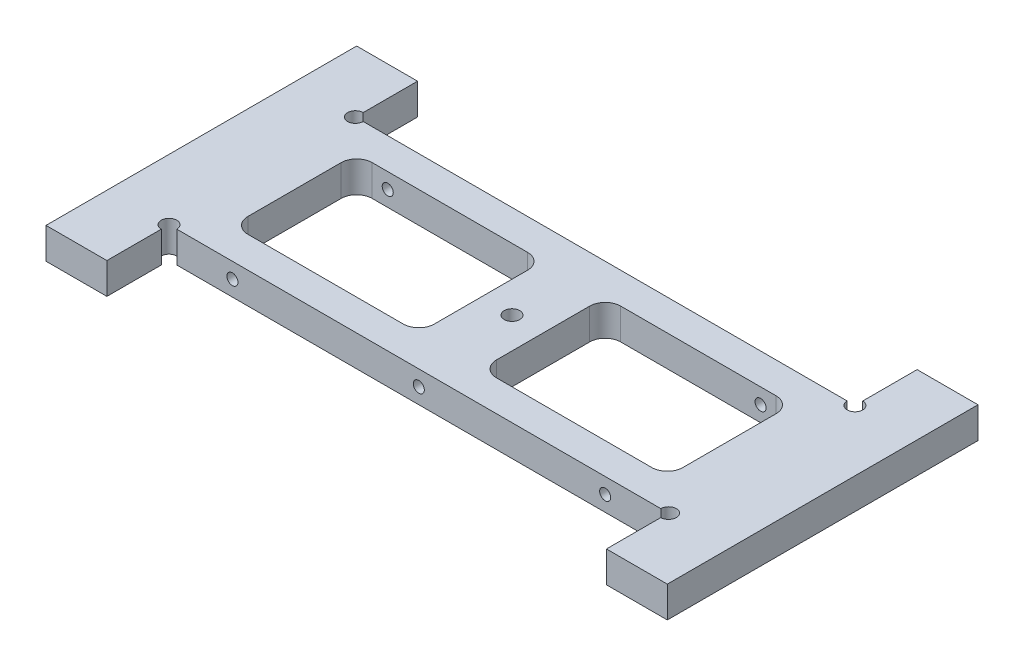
from build123d import *

# Parameters (mm, degrees)
BOSS_EXTRUDE1_DEPTH          = 19.05
BOSS_EXTRUDE1_DEPTH_BACK     = 19.05
SKETCH1_W                    = 101.6
SKETCH1_H                    = 6.35
F_4_40_TAPPED_HOLE1_D        = 2.2606
F_1_8_0_125_DIAMETER_HOLE1_D = 3.175
SKETCH8_W                    = 63.5
SKETCH8_H                    = 6.35
BOSS_EXTRUDE2_DEPTH          = 12.7
SKETCH11_W                   = 0.254
SKETCH11_H                   = 12.7
CUT_EXTRUDE4_DEPTH           = 72.278573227
SKETCH9_R                    = 1.5875
CUT_EXTRUDE2_DEPTH           = 72.278573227
SKETCH10_W                   = 38.1
SKETCH10_H                   = 25.4
CUT_EXTRUDE3_DEPTH           = 72.278573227
FILLET1_R                    = 3.175


with BuildPart() as part:
    # Sketch1 → Boss-Extrude1 (new, two sides: drawn at the far end of the back side and taken through both)
    with BuildSketch(Plane.XY.offset(-BOSS_EXTRUDE1_DEPTH_BACK)):
        Rectangle(SKETCH1_W, SKETCH1_H)
    extrude(amount=BOSS_EXTRUDE1_DEPTH + BOSS_EXTRUDE1_DEPTH_BACK)

    # 4-40 Tapped Hole1 (through all)
    with Locations(Plane.XY.offset(19.05)):
        with Locations((-38.1, 0), (0, 0), (38.1, 0)):
            Hole(F_4_40_TAPPED_HOLE1_D / 2)

    # 1_8 _0.125_ Diameter Hole1 (through all)
    with Locations(Plane(origin=(0, 3.175, 0), x_dir=(-1, 0, 0), z_dir=(0, 1, 0))):
        with Locations((0, 0)):
            Hole(F_1_8_0_125_DIAMETER_HOLE1_D / 2)

    # Sketch8 → Boss-Extrude2 (add)
    with BuildSketch(Plane.ZY.offset(50.8)):
        Rectangle(SKETCH8_W, SKETCH8_H)
    boss_extrude2 = extrude(amount=BOSS_EXTRUDE2_DEPTH)

    # Mirror2: Boss-Extrude2 across plane
    add(boss_extrude2.mirror(Plane(origin=(0, 0, 0), x_dir=(0, 0, 1), z_dir=(1, 0, 0))))

    # Sketch11 → Cut-Extrude4 (cut, through all)
    with BuildSketch(Plane(origin=(0, 3.175, 0), x_dir=(1, 0, 0), z_dir=(0, 1, 0))):
        with Locations((-50.927, 25.4)):
            Rectangle(SKETCH11_W, SKETCH11_H)
        with Locations((-50.927, -25.4)):
            Rectangle(SKETCH11_W, SKETCH11_H)
        with Locations((50.927, -25.4)):
            Rectangle(SKETCH11_W, SKETCH11_H)
        with Locations((50.927, 25.4)):
            Rectangle(SKETCH11_W, SKETCH11_H)
    extrude(amount=-CUT_EXTRUDE4_DEPTH, mode=Mode.SUBTRACT)

    # Sketch9 → Cut-Extrude2 (cut, through all)
    with BuildSketch(Plane(origin=(0, 3.175, 0), x_dir=(1, 0, 0), z_dir=(0, 1, 0))):
        with Locations((-51.054, 19.05)):
            Circle(SKETCH9_R)
        with Locations((-51.054, -19.05)):
            Circle(SKETCH9_R)
        with Locations((51.054, -19.05)):
            Circle(SKETCH9_R)
        with Locations((51.054, 19.05)):
            Circle(SKETCH9_R)
    extrude(amount=-CUT_EXTRUDE2_DEPTH, mode=Mode.SUBTRACT)

    # Sketch10 → Cut-Extrude3 (cut, through all)
    with BuildSketch(Plane(origin=(0, 3.175, 0), x_dir=(1, 0, 0), z_dir=(0, 1, 0))):
        with Locations((-25.4, 0)):
            Rectangle(SKETCH10_W, SKETCH10_H)
        with Locations((25.4, 0)):
            Rectangle(SKETCH10_W, SKETCH10_H)
    extrude(amount=-CUT_EXTRUDE3_DEPTH, mode=Mode.SUBTRACT)

    # Fillet1
    fillet1_edges = [part.edges().sort_by_distance(p)[0] for p in [
        (-44.45, 0, -12.7),
        (-6.35, 0, 12.7),
        (-44.45, 0, 12.7),
        (-6.35, 0, -12.7),
        (6.35, 0, -12.7),
        (44.45, 0, 12.7),
        (44.45, 0, -12.7),
        (6.35, 0, 12.7),
    ]]
    fillet(fillet1_edges, radius=FILLET1_R)


solid = part.part
